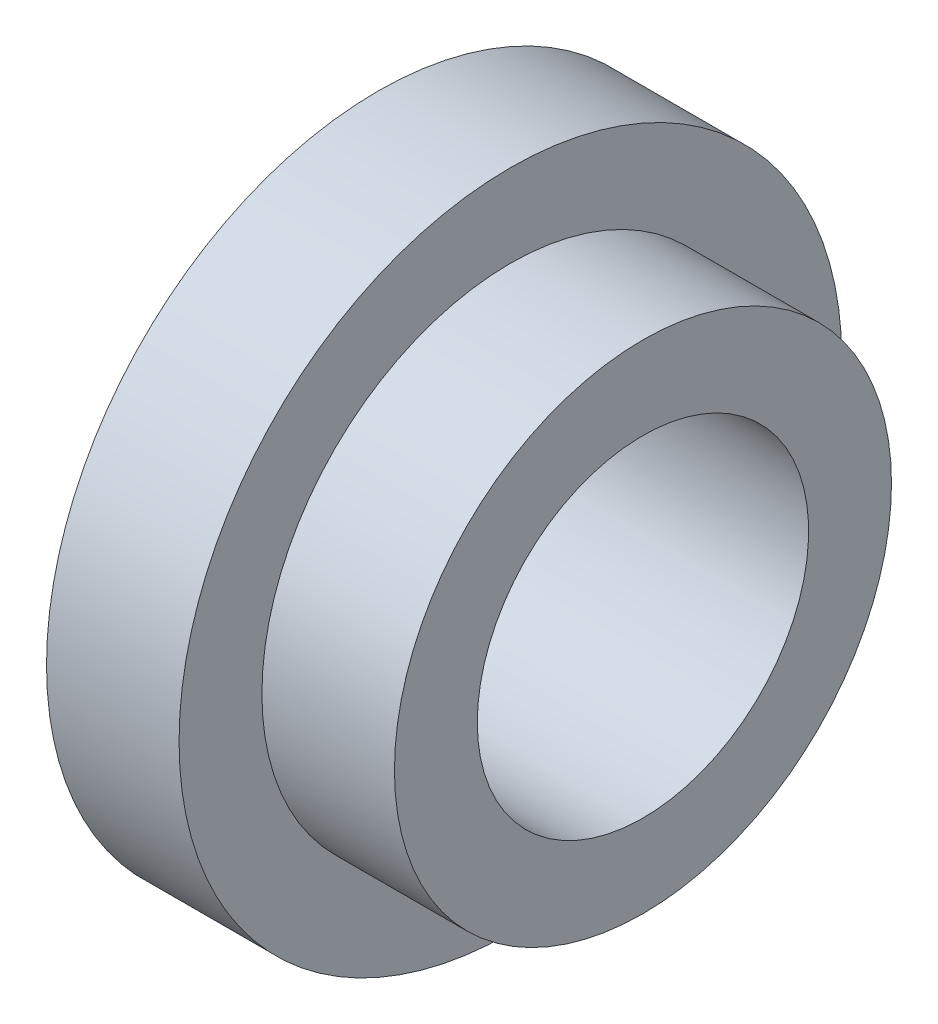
from build123d import *


with BuildPart() as part:
    # Szkic1 → Obr_t1 (revolve)
    with BuildSketch(Plane.XY, mode=Mode.PRIVATE) as obr_t1_sk:
        Polygon((0, 25), (0, 50), (20, 50), (20, 37.5), (40, 37.5), (40, 25), align=None)
    revolve(obr_t1_sk.sketch.rotate(Axis((0, 0, 0), (1, 0, 0)), 90), axis=Axis((0, 0, 0), (1, 0, 0)))


solid = part.part
